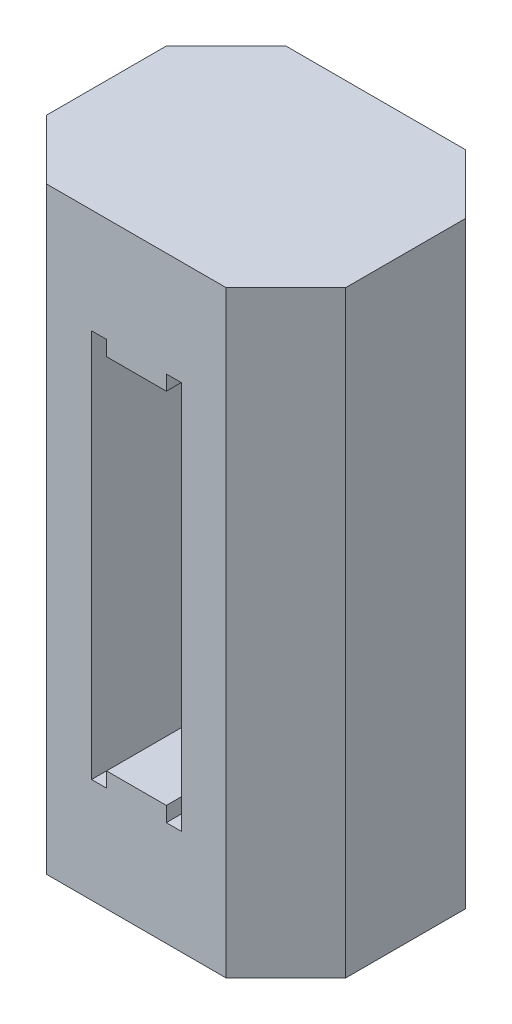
from build123d import *

# Parameters (mm, degrees)
ESQUISSE1_W             = 10
ESQUISSE1_H             = 20
BASE_EXTRUSION_DEPTH    = 8
ENL_V_MAT_EXTRU_1_DEPTH = 24.748684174
CHANFREIN1_SIZE         = 2


with BuildPart() as part:
    # Esquisse1 → Base-Extrusion (new body)
    with BuildSketch(Plane.XY):
        with Locations((5, 10)):
            Rectangle(ESQUISSE1_W, ESQUISSE1_H)
    extrude(amount=BASE_EXTRUSION_DEPTH)

    # Esquisse2 → Enl_v. mat.-Extru.1 (cut, through all)
    with BuildSketch(Plane.XY.offset(8)):
        Polygon((3.5, 16.5), (4, 16.5), (4, 16), (6, 16), (6, 16.5), (6.5, 16.5), (6.5, 3.5), (6, 3.5), (6, 4), (4, 4), (4, 3.5), (3.5, 3.5), align=None)
    extrude(amount=-ENL_V_MAT_EXTRU_1_DEPTH, mode=Mode.SUBTRACT)

    # Chanfrein1
    chanfrein1_edges = [part.edges().sort_by_distance(p)[0] for p in [
        (0, 10, 0),
        (0, 10, 8),
        (10, 10, 0),
        (10, 10, 8),
    ]]
    chamfer(chanfrein1_edges, length=CHANFREIN1_SIZE)


solid = part.part
